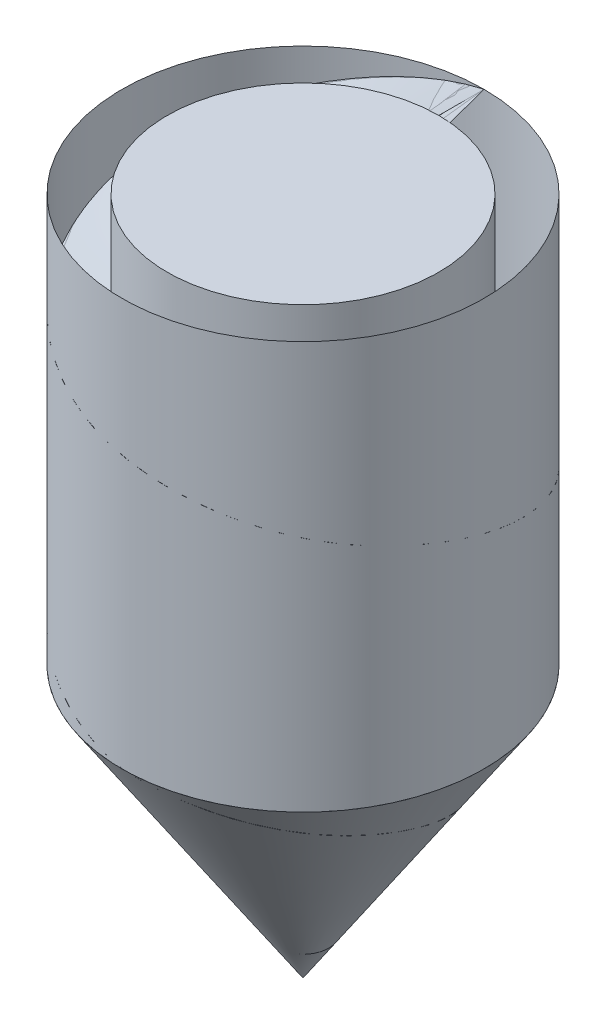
from build123d import *


with BuildPart() as part:
    # Skizze1 → Grundk_rper (revolve)
    with BuildSketch(Plane.XY, mode=Mode.PRIVATE) as grundk_rper_sk:
        Polygon((0, 0), (3, 6), (3, 15), (0, 15), align=None)
    revolve(grundk_rper_sk.sketch.rotate(Axis((0, -3.713554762, 0), (0, 1, 0)), 90), axis=Axis((0, -3.713554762, 0), (0, 1, 0)))


solid = part.part
